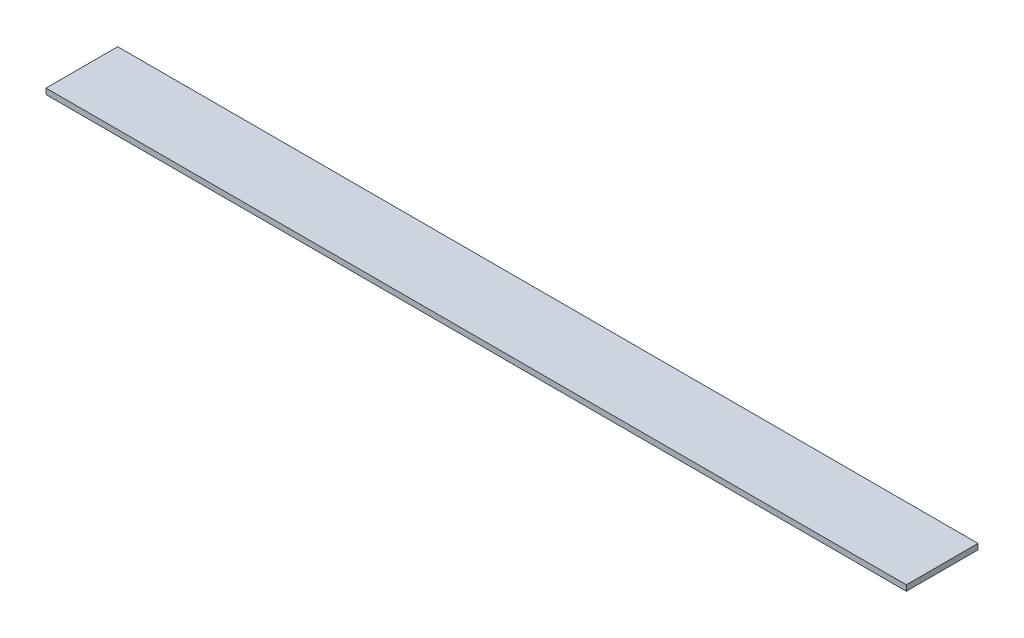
ISO-10303-21;
HEADER;
FILE_DESCRIPTION(('STEP AP214'),'2;1');
FILE_NAME('part.step','',(''),(''),'','','');
FILE_SCHEMA(('AUTOMOTIVE_DESIGN { 1 0 10303 214 1 1 1 1 }'));
ENDSEC;
DATA;
#1=APPLICATION_CONTEXT('core data for automotive mechanical design processes');
#2=APPLICATION_PROTOCOL_DEFINITION('international standard','automotive_design',2000,#1);
#3=PRODUCT_CONTEXT('',#1,'mechanical');
#4=PRODUCT('Part','Part','',(#3));
#5=PRODUCT_RELATED_PRODUCT_CATEGORY('part','',(#4));
#6=PRODUCT_DEFINITION_FORMATION('','',#4);
#7=PRODUCT_DEFINITION_CONTEXT('part definition',#1,'design');
#8=PRODUCT_DEFINITION('design','',#6,#7);
#9=PRODUCT_DEFINITION_SHAPE('','',#8);
#10=(LENGTH_UNIT() NAMED_UNIT(*) SI_UNIT(.MILLI.,.METRE.));
#11=(NAMED_UNIT(*) PLANE_ANGLE_UNIT() SI_UNIT($,.RADIAN.));
#12=(NAMED_UNIT(*) SI_UNIT($,.STERADIAN.) SOLID_ANGLE_UNIT());
#13=UNCERTAINTY_MEASURE_WITH_UNIT(LENGTH_MEASURE(1.E-05),#10,'distance_accuracy_value','');
#14=(GEOMETRIC_REPRESENTATION_CONTEXT(3) GLOBAL_UNCERTAINTY_ASSIGNED_CONTEXT((#13)) GLOBAL_UNIT_ASSIGNED_CONTEXT((#10,
#11,#12)) REPRESENTATION_CONTEXT('',''));
#15=CARTESIAN_POINT('',(0.,0.,0.));
#16=DIRECTION('',(0.,0.,1.));
#17=DIRECTION('',(1.,0.,0.));
#18=AXIS2_PLACEMENT_3D('',#15,#16,#17);
#19=CARTESIAN_POINT('',(304.8,4.,25.4));
#20=DIRECTION('',(-1.,0.,0.));
#21=DIRECTION('',(0.,0.,1.));
#22=AXIS2_PLACEMENT_3D('',#19,#20,#21);
#23=PLANE('',#22);
#24=DIRECTION('',(0.,0.,-1.));
#25=VECTOR('',#24,1.);
#26=CARTESIAN_POINT('',(304.8,0.,25.4));
#27=LINE('',#26,#25);
#28=CARTESIAN_POINT('',(304.8,0.,25.4));
#29=VERTEX_POINT('',#28);
#30=CARTESIAN_POINT('',(304.8,0.,-25.4));
#31=VERTEX_POINT('',#30);
#32=EDGE_CURVE('E115',#29,#31,#27,.T.);
#33=ORIENTED_EDGE('',*,*,#32,.T.);
#34=DIRECTION('',(0.,-1.,0.));
#35=VECTOR('',#34,1.);
#36=CARTESIAN_POINT('',(304.8,4.,-25.4));
#37=LINE('',#36,#35);
#38=CARTESIAN_POINT('',(304.8,4.,-25.4));
#39=VERTEX_POINT('',#38);
#40=EDGE_CURVE('E11',#39,#31,#37,.T.);
#41=ORIENTED_EDGE('',*,*,#40,.F.);
#42=DIRECTION('',(0.,0.,-1.));
#43=VECTOR('',#42,1.);
#44=CARTESIAN_POINT('',(304.8,4.,25.4));
#45=LINE('',#44,#43);
#46=CARTESIAN_POINT('',(304.8,4.,25.4));
#47=VERTEX_POINT('',#46);
#48=EDGE_CURVE('E99',#47,#39,#45,.T.);
#49=ORIENTED_EDGE('',*,*,#48,.F.);
#50=DIRECTION('',(0.,-1.,0.));
#51=VECTOR('',#50,1.);
#52=CARTESIAN_POINT('',(304.8,4.,25.4));
#53=LINE('',#52,#51);
#54=EDGE_CURVE('E111',#47,#29,#53,.T.);
#55=ORIENTED_EDGE('',*,*,#54,.T.);
#56=EDGE_LOOP('',(#33,#41,#49,#55));
#57=FACE_BOUND('',#56,.T.);
#58=ADVANCED_FACE('F47',(#57),#23,.F.);
#59=CARTESIAN_POINT('',(-304.8,4.,-25.4));
#60=DIRECTION('',(0.,0.,1.));
#61=DIRECTION('',(1.,0.,0.));
#62=AXIS2_PLACEMENT_3D('',#59,#60,#61);
#63=PLANE('',#62);
#64=DIRECTION('',(-1.,0.,0.));
#65=VECTOR('',#64,1.);
#66=CARTESIAN_POINT('',(-304.8,0.,-25.4));
#67=LINE('',#66,#65);
#68=CARTESIAN_POINT('',(-304.8,0.,-25.4));
#69=VERTEX_POINT('',#68);
#70=EDGE_CURVE('E104',#31,#69,#67,.T.);
#71=ORIENTED_EDGE('',*,*,#70,.T.);
#72=DIRECTION('',(0.,-1.,0.));
#73=VECTOR('',#72,1.);
#74=CARTESIAN_POINT('',(-304.8,4.,-25.4));
#75=LINE('',#74,#73);
#76=CARTESIAN_POINT('',(-304.8,4.,-25.4));
#77=VERTEX_POINT('',#76);
#78=EDGE_CURVE('E56',#77,#69,#75,.T.);
#79=ORIENTED_EDGE('',*,*,#78,.F.);
#80=DIRECTION('',(-1.,0.,0.));
#81=VECTOR('',#80,1.);
#82=CARTESIAN_POINT('',(-304.8,4.,-25.4));
#83=LINE('',#82,#81);
#84=EDGE_CURVE('E94',#39,#77,#83,.T.);
#85=ORIENTED_EDGE('',*,*,#84,.F.);
#86=ORIENTED_EDGE('',*,*,#40,.T.);
#87=EDGE_LOOP('',(#71,#79,#85,#86));
#88=FACE_BOUND('',#87,.T.);
#89=ADVANCED_FACE('F103',(#88),#63,.F.);
#90=CARTESIAN_POINT('',(-304.8,4.,25.4));
#91=DIRECTION('',(1.,0.,0.));
#92=DIRECTION('',(0.,0.,-1.));
#93=AXIS2_PLACEMENT_3D('',#90,#91,#92);
#94=PLANE('',#93);
#95=DIRECTION('',(0.,0.,1.));
#96=VECTOR('',#95,1.);
#97=CARTESIAN_POINT('',(-304.8,0.,25.4));
#98=LINE('',#97,#96);
#99=CARTESIAN_POINT('',(-304.8,0.,25.4));
#100=VERTEX_POINT('',#99);
#101=EDGE_CURVE('E81',#69,#100,#98,.T.);
#102=ORIENTED_EDGE('',*,*,#101,.T.);
#103=DIRECTION('',(0.,-1.,0.));
#104=VECTOR('',#103,1.);
#105=CARTESIAN_POINT('',(-304.8,4.,25.4));
#106=LINE('',#105,#104);
#107=CARTESIAN_POINT('',(-304.8,4.,25.4));
#108=VERTEX_POINT('',#107);
#109=EDGE_CURVE('E106',#108,#100,#106,.T.);
#110=ORIENTED_EDGE('',*,*,#109,.F.);
#111=DIRECTION('',(0.,0.,1.));
#112=VECTOR('',#111,1.);
#113=CARTESIAN_POINT('',(-304.8,4.,25.4));
#114=LINE('',#113,#112);
#115=EDGE_CURVE('E97',#77,#108,#114,.T.);
#116=ORIENTED_EDGE('',*,*,#115,.F.);
#117=ORIENTED_EDGE('',*,*,#78,.T.);
#118=EDGE_LOOP('',(#102,#110,#116,#117));
#119=FACE_BOUND('',#118,.T.);
#120=ADVANCED_FACE('F107',(#119),#94,.F.);
#121=CARTESIAN_POINT('',(-304.8,4.,25.4));
#122=DIRECTION('',(0.,0.,-1.));
#123=DIRECTION('',(-1.,0.,0.));
#124=AXIS2_PLACEMENT_3D('',#121,#122,#123);
#125=PLANE('',#124);
#126=DIRECTION('',(1.,0.,0.));
#127=VECTOR('',#126,1.);
#128=CARTESIAN_POINT('',(-304.8,0.,25.4));
#129=LINE('',#128,#127);
#130=EDGE_CURVE('E87',#100,#29,#129,.T.);
#131=ORIENTED_EDGE('',*,*,#130,.T.);
#132=ORIENTED_EDGE('',*,*,#54,.F.);
#133=DIRECTION('',(1.,0.,0.));
#134=VECTOR('',#133,1.);
#135=CARTESIAN_POINT('',(-304.8,4.,25.4));
#136=LINE('',#135,#134);
#137=EDGE_CURVE('E64',#108,#47,#136,.T.);
#138=ORIENTED_EDGE('',*,*,#137,.F.);
#139=ORIENTED_EDGE('',*,*,#109,.T.);
#140=EDGE_LOOP('',(#131,#132,#138,#139));
#141=FACE_BOUND('',#140,.T.);
#142=ADVANCED_FACE('F128',(#141),#125,.F.);
#143=CARTESIAN_POINT('',(0.,4.,0.));
#144=DIRECTION('',(0.,-1.,0.));
#145=DIRECTION('',(0.,0.,-1.));
#146=AXIS2_PLACEMENT_3D('',#143,#144,#145);
#147=PLANE('',#146);
#148=ORIENTED_EDGE('',*,*,#48,.T.);
#149=ORIENTED_EDGE('',*,*,#84,.T.);
#150=ORIENTED_EDGE('',*,*,#115,.T.);
#151=ORIENTED_EDGE('',*,*,#137,.T.);
#152=EDGE_LOOP('',(#148,#149,#150,#151));
#153=FACE_BOUND('',#152,.T.);
#154=ADVANCED_FACE('F95',(#153),#147,.F.);
#155=CARTESIAN_POINT('',(0.,0.,0.));
#156=DIRECTION('',(0.,-1.,0.));
#157=DIRECTION('',(0.,0.,-1.));
#158=AXIS2_PLACEMENT_3D('',#155,#156,#157);
#159=PLANE('',#158);
#160=ORIENTED_EDGE('',*,*,#32,.F.);
#161=ORIENTED_EDGE('',*,*,#130,.F.);
#162=ORIENTED_EDGE('',*,*,#101,.F.);
#163=ORIENTED_EDGE('',*,*,#70,.F.);
#164=EDGE_LOOP('',(#160,#161,#162,#163));
#165=FACE_BOUND('',#164,.T.);
#166=ADVANCED_FACE('F131',(#165),#159,.T.);
#167=CLOSED_SHELL('',(#58,#89,#120,#142,#154,#166));
#168=MANIFOLD_SOLID_BREP('B2',#167);
#169=ADVANCED_BREP_SHAPE_REPRESENTATION('',(#18,#168),#14);
#170=SHAPE_DEFINITION_REPRESENTATION(#9,#169);
ENDSEC;
END-ISO-10303-21;
